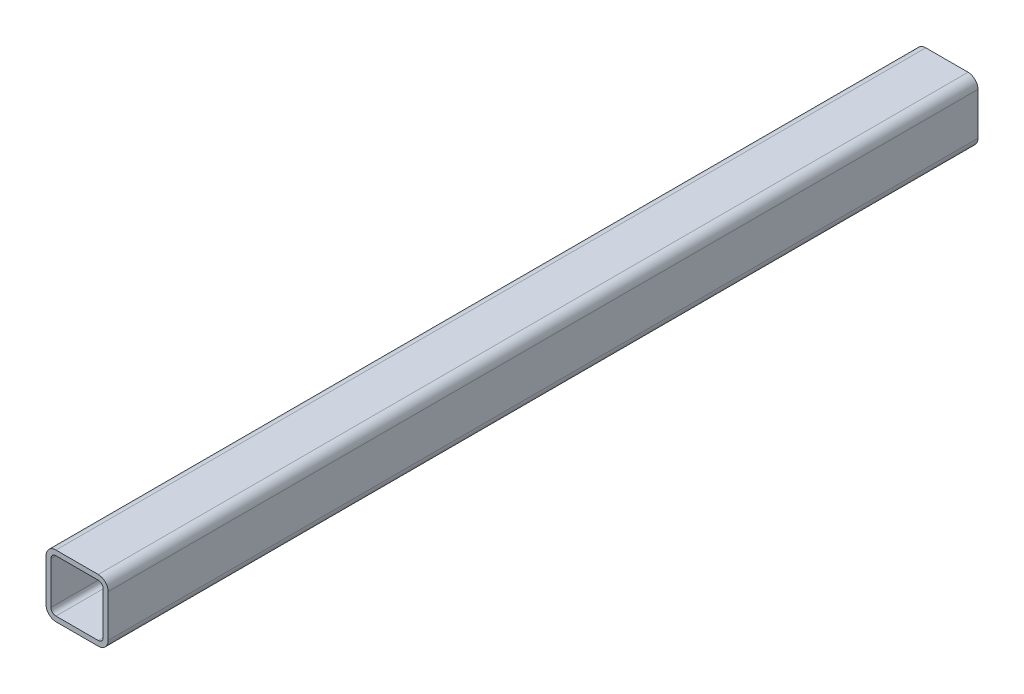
ISO-10303-21;
HEADER;
FILE_DESCRIPTION(('STEP AP214'),'2;1');
FILE_NAME('part.step','',(''),(''),'','','');
FILE_SCHEMA(('AUTOMOTIVE_DESIGN { 1 0 10303 214 1 1 1 1 }'));
ENDSEC;
DATA;
#1=APPLICATION_CONTEXT('core data for automotive mechanical design processes');
#2=APPLICATION_PROTOCOL_DEFINITION('international standard','automotive_design',2000,#1);
#3=PRODUCT_CONTEXT('',#1,'mechanical');
#4=PRODUCT('Part','Part','',(#3));
#5=PRODUCT_RELATED_PRODUCT_CATEGORY('part','',(#4));
#6=PRODUCT_DEFINITION_FORMATION('','',#4);
#7=PRODUCT_DEFINITION_CONTEXT('part definition',#1,'design');
#8=PRODUCT_DEFINITION('design','',#6,#7);
#9=PRODUCT_DEFINITION_SHAPE('','',#8);
#10=(LENGTH_UNIT() NAMED_UNIT(*) SI_UNIT(.MILLI.,.METRE.));
#11=(NAMED_UNIT(*) PLANE_ANGLE_UNIT() SI_UNIT($,.RADIAN.));
#12=(NAMED_UNIT(*) SI_UNIT($,.STERADIAN.) SOLID_ANGLE_UNIT());
#13=UNCERTAINTY_MEASURE_WITH_UNIT(LENGTH_MEASURE(1.E-05),#10,'distance_accuracy_value','');
#14=(GEOMETRIC_REPRESENTATION_CONTEXT(3) GLOBAL_UNCERTAINTY_ASSIGNED_CONTEXT((#13)) GLOBAL_UNIT_ASSIGNED_CONTEXT((#10,
#11,#12)) REPRESENTATION_CONTEXT('',''));
#15=CARTESIAN_POINT('',(0.,0.,0.));
#16=DIRECTION('',(0.,0.,1.));
#17=DIRECTION('',(1.,0.,0.));
#18=AXIS2_PLACEMENT_3D('',#15,#16,#17);
#19=CARTESIAN_POINT('',(-12.97432,12.97432,266.7));
#20=DIRECTION('',(0.,0.,1.));
#21=DIRECTION('',(1.,0.,0.));
#22=AXIS2_PLACEMENT_3D('',#19,#20,#21);
#23=PLANE('',#22);
#24=CARTESIAN_POINT('',(-12.97432,12.97432,266.7));
#25=DIRECTION('',(0.,0.,1.));
#26=DIRECTION('',(1.,0.,0.));
#27=AXIS2_PLACEMENT_3D('',#24,#25,#26);
#28=CIRCLE('',#27,6.07568);
#29=CARTESIAN_POINT('',(-12.97432,19.05,266.7));
#30=VERTEX_POINT('',#29);
#31=CARTESIAN_POINT('',(-19.05,12.97432,266.7));
#32=VERTEX_POINT('',#31);
#33=EDGE_CURVE('E260',#30,#32,#28,.T.);
#34=ORIENTED_EDGE('',*,*,#33,.T.);
#35=DIRECTION('',(0.,-1.,0.));
#36=VECTOR('',#35,1.);
#37=CARTESIAN_POINT('',(-19.05,12.97432,266.7));
#38=LINE('',#37,#36);
#39=CARTESIAN_POINT('',(-19.05,-12.97432,266.7));
#40=VERTEX_POINT('',#39);
#41=EDGE_CURVE('E263',#32,#40,#38,.T.);
#42=ORIENTED_EDGE('',*,*,#41,.T.);
#43=CARTESIAN_POINT('',(-12.97432,-12.97432,266.7));
#44=DIRECTION('',(0.,0.,1.));
#45=DIRECTION('',(-1.,0.,0.));
#46=AXIS2_PLACEMENT_3D('',#43,#44,#45);
#47=CIRCLE('',#46,6.07568);
#48=CARTESIAN_POINT('',(-12.97432,-19.05,266.7));
#49=VERTEX_POINT('',#48);
#50=EDGE_CURVE('E266',#40,#49,#47,.T.);
#51=ORIENTED_EDGE('',*,*,#50,.T.);
#52=DIRECTION('',(1.,0.,0.));
#53=VECTOR('',#52,1.);
#54=CARTESIAN_POINT('',(-12.97432,-19.05,266.7));
#55=LINE('',#54,#53);
#56=CARTESIAN_POINT('',(12.97432,-19.05,266.7));
#57=VERTEX_POINT('',#56);
#58=EDGE_CURVE('E268',#49,#57,#55,.T.);
#59=ORIENTED_EDGE('',*,*,#58,.T.);
#60=CARTESIAN_POINT('',(12.97432,-12.97432,266.7));
#61=DIRECTION('',(0.,0.,1.));
#62=DIRECTION('',(1.,0.,0.));
#63=AXIS2_PLACEMENT_3D('',#60,#61,#62);
#64=CIRCLE('',#63,6.07568);
#65=CARTESIAN_POINT('',(19.05,-12.97432,266.7));
#66=VERTEX_POINT('',#65);
#67=EDGE_CURVE('E270',#57,#66,#64,.T.);
#68=ORIENTED_EDGE('',*,*,#67,.T.);
#69=DIRECTION('',(0.,1.,0.));
#70=VECTOR('',#69,1.);
#71=CARTESIAN_POINT('',(19.05,12.97432,266.7));
#72=LINE('',#71,#70);
#73=CARTESIAN_POINT('',(19.05,12.97432,266.7));
#74=VERTEX_POINT('',#73);
#75=EDGE_CURVE('E272',#66,#74,#72,.T.);
#76=ORIENTED_EDGE('',*,*,#75,.T.);
#77=CARTESIAN_POINT('',(12.97432,12.97432,266.7));
#78=DIRECTION('',(0.,0.,1.));
#79=DIRECTION('',(1.,0.,0.));
#80=AXIS2_PLACEMENT_3D('',#77,#78,#79);
#81=CIRCLE('',#80,6.07568);
#82=CARTESIAN_POINT('',(12.97432,19.05,266.7));
#83=VERTEX_POINT('',#82);
#84=EDGE_CURVE('E274',#74,#83,#81,.T.);
#85=ORIENTED_EDGE('',*,*,#84,.T.);
#86=DIRECTION('',(-1.,0.,0.));
#87=VECTOR('',#86,1.);
#88=CARTESIAN_POINT('',(-12.97432,19.05,266.7));
#89=LINE('',#88,#87);
#90=EDGE_CURVE('E276',#83,#30,#89,.T.);
#91=ORIENTED_EDGE('',*,*,#90,.T.);
#92=EDGE_LOOP('',(#34,#42,#51,#59,#68,#76,#85,#91));
#93=FACE_BOUND('',#92,.T.);
#94=DIRECTION('',(0.,-1.,0.));
#95=VECTOR('',#94,1.);
#96=CARTESIAN_POINT('',(-16.01216,12.97432,266.7));
#97=LINE('',#96,#95);
#98=CARTESIAN_POINT('',(-16.01216,12.97432,266.7));
#99=VERTEX_POINT('',#98);
#100=CARTESIAN_POINT('',(-16.01216,-12.97432,266.7));
#101=VERTEX_POINT('',#100);
#102=EDGE_CURVE('E203',#99,#101,#97,.T.);
#103=ORIENTED_EDGE('',*,*,#102,.F.);
#104=CARTESIAN_POINT('',(-12.97432,12.97432,266.7));
#105=DIRECTION('',(0.,0.,1.));
#106=DIRECTION('',(1.,0.,0.));
#107=AXIS2_PLACEMENT_3D('',#104,#105,#106);
#108=CIRCLE('',#107,3.03784);
#109=CARTESIAN_POINT('',(-12.97432,16.01216,266.7));
#110=VERTEX_POINT('',#109);
#111=EDGE_CURVE('E195',#110,#99,#108,.T.);
#112=ORIENTED_EDGE('',*,*,#111,.F.);
#113=DIRECTION('',(-1.,0.,0.));
#114=VECTOR('',#113,1.);
#115=CARTESIAN_POINT('',(-12.97432,16.01216,266.7));
#116=LINE('',#115,#114);
#117=CARTESIAN_POINT('',(12.97432,16.01216,266.7));
#118=VERTEX_POINT('',#117);
#119=EDGE_CURVE('E228',#118,#110,#116,.T.);
#120=ORIENTED_EDGE('',*,*,#119,.F.);
#121=CARTESIAN_POINT('',(12.97432,12.97432,266.7));
#122=DIRECTION('',(0.,0.,1.));
#123=DIRECTION('',(1.,0.,0.));
#124=AXIS2_PLACEMENT_3D('',#121,#122,#123);
#125=CIRCLE('',#124,3.03784);
#126=CARTESIAN_POINT('',(16.01216,12.97432,266.7));
#127=VERTEX_POINT('',#126);
#128=EDGE_CURVE('E226',#127,#118,#125,.T.);
#129=ORIENTED_EDGE('',*,*,#128,.F.);
#130=DIRECTION('',(0.,1.,0.));
#131=VECTOR('',#130,1.);
#132=CARTESIAN_POINT('',(16.01216,12.97432,266.7));
#133=LINE('',#132,#131);
#134=CARTESIAN_POINT('',(16.01216,-12.97432,266.7));
#135=VERTEX_POINT('',#134);
#136=EDGE_CURVE('E224',#135,#127,#133,.T.);
#137=ORIENTED_EDGE('',*,*,#136,.F.);
#138=CARTESIAN_POINT('',(12.97432,-12.97432,266.7));
#139=DIRECTION('',(0.,0.,1.));
#140=DIRECTION('',(1.,0.,0.));
#141=AXIS2_PLACEMENT_3D('',#138,#139,#140);
#142=CIRCLE('',#141,3.03784);
#143=CARTESIAN_POINT('',(12.97432,-16.01216,266.7));
#144=VERTEX_POINT('',#143);
#145=EDGE_CURVE('E222',#144,#135,#142,.T.);
#146=ORIENTED_EDGE('',*,*,#145,.F.);
#147=DIRECTION('',(1.,0.,0.));
#148=VECTOR('',#147,1.);
#149=CARTESIAN_POINT('',(-12.97432,-16.01216,266.7));
#150=LINE('',#149,#148);
#151=CARTESIAN_POINT('',(-12.97432,-16.01216,266.7));
#152=VERTEX_POINT('',#151);
#153=EDGE_CURVE('E218',#152,#144,#150,.T.);
#154=ORIENTED_EDGE('',*,*,#153,.F.);
#155=CARTESIAN_POINT('',(-12.97432,-12.97432,266.7));
#156=DIRECTION('',(0.,0.,1.));
#157=DIRECTION('',(1.,0.,0.));
#158=AXIS2_PLACEMENT_3D('',#155,#156,#157);
#159=CIRCLE('',#158,3.03784);
#160=EDGE_CURVE('E216',#101,#152,#159,.T.);
#161=ORIENTED_EDGE('',*,*,#160,.F.);
#162=EDGE_LOOP('',(#103,#112,#120,#129,#137,#146,#154,#161));
#163=FACE_BOUND('',#162,.T.);
#164=ADVANCED_FACE('F82',(#93,#163),#23,.T.);
#165=CARTESIAN_POINT('',(-12.97432,12.97432,-266.7));
#166=DIRECTION('',(0.,0.,1.));
#167=DIRECTION('',(1.,0.,0.));
#168=AXIS2_PLACEMENT_3D('',#165,#166,#167);
#169=PLANE('',#168);
#170=CARTESIAN_POINT('',(-12.97432,12.97432,-266.7));
#171=DIRECTION('',(0.,0.,1.));
#172=DIRECTION('',(1.,0.,0.));
#173=AXIS2_PLACEMENT_3D('',#170,#171,#172);
#174=CIRCLE('',#173,6.07568);
#175=CARTESIAN_POINT('',(-12.97432,19.05,-266.7));
#176=VERTEX_POINT('',#175);
#177=CARTESIAN_POINT('',(-19.05,12.97432,-266.7));
#178=VERTEX_POINT('',#177);
#179=EDGE_CURVE('E211',#176,#178,#174,.T.);
#180=ORIENTED_EDGE('',*,*,#179,.F.);
#181=DIRECTION('',(-1.,0.,0.));
#182=VECTOR('',#181,1.);
#183=CARTESIAN_POINT('',(-12.97432,19.05,-266.7));
#184=LINE('',#183,#182);
#185=CARTESIAN_POINT('',(12.97432,19.05,-266.7));
#186=VERTEX_POINT('',#185);
#187=EDGE_CURVE('E264',#186,#176,#184,.T.);
#188=ORIENTED_EDGE('',*,*,#187,.F.);
#189=CARTESIAN_POINT('',(12.97432,12.97432,-266.7));
#190=DIRECTION('',(0.,0.,1.));
#191=DIRECTION('',(1.,0.,0.));
#192=AXIS2_PLACEMENT_3D('',#189,#190,#191);
#193=CIRCLE('',#192,6.07568);
#194=CARTESIAN_POINT('',(19.05,12.97432,-266.7));
#195=VERTEX_POINT('',#194);
#196=EDGE_CURVE('E291',#195,#186,#193,.T.);
#197=ORIENTED_EDGE('',*,*,#196,.F.);
#198=DIRECTION('',(0.,1.,0.));
#199=VECTOR('',#198,1.);
#200=CARTESIAN_POINT('',(19.05,12.97432,-266.7));
#201=LINE('',#200,#199);
#202=CARTESIAN_POINT('',(19.05,-12.97432,-266.7));
#203=VERTEX_POINT('',#202);
#204=EDGE_CURVE('E289',#203,#195,#201,.T.);
#205=ORIENTED_EDGE('',*,*,#204,.F.);
#206=CARTESIAN_POINT('',(12.97432,-12.97432,-266.7));
#207=DIRECTION('',(0.,0.,1.));
#208=DIRECTION('',(1.,0.,0.));
#209=AXIS2_PLACEMENT_3D('',#206,#207,#208);
#210=CIRCLE('',#209,6.07568);
#211=CARTESIAN_POINT('',(12.97432,-19.05,-266.7));
#212=VERTEX_POINT('',#211);
#213=EDGE_CURVE('E287',#212,#203,#210,.T.);
#214=ORIENTED_EDGE('',*,*,#213,.F.);
#215=DIRECTION('',(1.,0.,0.));
#216=VECTOR('',#215,1.);
#217=CARTESIAN_POINT('',(-12.97432,-19.05,-266.7));
#218=LINE('',#217,#216);
#219=CARTESIAN_POINT('',(-12.97432,-19.05,-266.7));
#220=VERTEX_POINT('',#219);
#221=EDGE_CURVE('E285',#220,#212,#218,.T.);
#222=ORIENTED_EDGE('',*,*,#221,.F.);
#223=CARTESIAN_POINT('',(-12.97432,-12.97432,-266.7));
#224=DIRECTION('',(0.,0.,1.));
#225=DIRECTION('',(-1.,0.,0.));
#226=AXIS2_PLACEMENT_3D('',#223,#224,#225);
#227=CIRCLE('',#226,6.07568);
#228=CARTESIAN_POINT('',(-19.05,-12.97432,-266.7));
#229=VERTEX_POINT('',#228);
#230=EDGE_CURVE('E283',#229,#220,#227,.T.);
#231=ORIENTED_EDGE('',*,*,#230,.F.);
#232=DIRECTION('',(0.,-1.,0.));
#233=VECTOR('',#232,1.);
#234=CARTESIAN_POINT('',(-19.05,12.97432,-266.7));
#235=LINE('',#234,#233);
#236=EDGE_CURVE('E281',#178,#229,#235,.T.);
#237=ORIENTED_EDGE('',*,*,#236,.F.);
#238=EDGE_LOOP('',(#180,#188,#197,#205,#214,#222,#231,#237));
#239=FACE_BOUND('',#238,.T.);
#240=CARTESIAN_POINT('',(-12.97432,12.97432,-266.7));
#241=DIRECTION('',(0.,0.,1.));
#242=DIRECTION('',(1.,0.,0.));
#243=AXIS2_PLACEMENT_3D('',#240,#241,#242);
#244=CIRCLE('',#243,3.03784);
#245=CARTESIAN_POINT('',(-12.97432,16.01216,-266.7));
#246=VERTEX_POINT('',#245);
#247=CARTESIAN_POINT('',(-16.01216,12.97432,-266.7));
#248=VERTEX_POINT('',#247);
#249=EDGE_CURVE('E105',#246,#248,#244,.T.);
#250=ORIENTED_EDGE('',*,*,#249,.T.);
#251=DIRECTION('',(0.,-1.,0.));
#252=VECTOR('',#251,1.);
#253=CARTESIAN_POINT('',(-16.01216,12.97432,-266.7));
#254=LINE('',#253,#252);
#255=CARTESIAN_POINT('',(-16.01216,-12.97432,-266.7));
#256=VERTEX_POINT('',#255);
#257=EDGE_CURVE('E210',#248,#256,#254,.T.);
#258=ORIENTED_EDGE('',*,*,#257,.T.);
#259=CARTESIAN_POINT('',(-12.97432,-12.97432,-266.7));
#260=DIRECTION('',(0.,0.,1.));
#261=DIRECTION('',(1.,0.,0.));
#262=AXIS2_PLACEMENT_3D('',#259,#260,#261);
#263=CIRCLE('',#262,3.03784);
#264=CARTESIAN_POINT('',(-12.97432,-16.01216,-266.7));
#265=VERTEX_POINT('',#264);
#266=EDGE_CURVE('E232',#256,#265,#263,.T.);
#267=ORIENTED_EDGE('',*,*,#266,.T.);
#268=DIRECTION('',(1.,0.,0.));
#269=VECTOR('',#268,1.);
#270=CARTESIAN_POINT('',(-12.97432,-16.01216,-266.7));
#271=LINE('',#270,#269);
#272=CARTESIAN_POINT('',(12.97432,-16.01216,-266.7));
#273=VERTEX_POINT('',#272);
#274=EDGE_CURVE('E235',#265,#273,#271,.T.);
#275=ORIENTED_EDGE('',*,*,#274,.T.);
#276=CARTESIAN_POINT('',(12.97432,-12.97432,-266.7));
#277=DIRECTION('',(0.,0.,1.));
#278=DIRECTION('',(1.,0.,0.));
#279=AXIS2_PLACEMENT_3D('',#276,#277,#278);
#280=CIRCLE('',#279,3.03784);
#281=CARTESIAN_POINT('',(16.01216,-12.97432,-266.7));
#282=VERTEX_POINT('',#281);
#283=EDGE_CURVE('E238',#273,#282,#280,.T.);
#284=ORIENTED_EDGE('',*,*,#283,.T.);
#285=DIRECTION('',(0.,1.,0.));
#286=VECTOR('',#285,1.);
#287=CARTESIAN_POINT('',(16.01216,12.97432,-266.7));
#288=LINE('',#287,#286);
#289=CARTESIAN_POINT('',(16.01216,12.97432,-266.7));
#290=VERTEX_POINT('',#289);
#291=EDGE_CURVE('E241',#282,#290,#288,.T.);
#292=ORIENTED_EDGE('',*,*,#291,.T.);
#293=CARTESIAN_POINT('',(12.97432,12.97432,-266.7));
#294=DIRECTION('',(0.,0.,1.));
#295=DIRECTION('',(1.,0.,0.));
#296=AXIS2_PLACEMENT_3D('',#293,#294,#295);
#297=CIRCLE('',#296,3.03784);
#298=CARTESIAN_POINT('',(12.97432,16.01216,-266.7));
#299=VERTEX_POINT('',#298);
#300=EDGE_CURVE('E244',#290,#299,#297,.T.);
#301=ORIENTED_EDGE('',*,*,#300,.T.);
#302=DIRECTION('',(-1.,0.,0.));
#303=VECTOR('',#302,1.);
#304=CARTESIAN_POINT('',(-12.97432,16.01216,-266.7));
#305=LINE('',#304,#303);
#306=EDGE_CURVE('E204',#299,#246,#305,.T.);
#307=ORIENTED_EDGE('',*,*,#306,.T.);
#308=EDGE_LOOP('',(#250,#258,#267,#275,#284,#292,#301,#307));
#309=FACE_BOUND('',#308,.T.);
#310=ADVANCED_FACE('F321',(#239,#309),#169,.F.);
#311=CARTESIAN_POINT('',(-12.97432,12.97432,266.7));
#312=DIRECTION('',(0.,0.,-1.));
#313=DIRECTION('',(-1.,0.,0.));
#314=AXIS2_PLACEMENT_3D('',#311,#312,#313);
#315=CYLINDRICAL_SURFACE('',#314,6.07568);
#316=ORIENTED_EDGE('',*,*,#179,.T.);
#317=DIRECTION('',(0.,0.,-1.));
#318=VECTOR('',#317,1.);
#319=CARTESIAN_POINT('',(-19.05,12.97432,266.7));
#320=LINE('',#319,#318);
#321=EDGE_CURVE('E12',#32,#178,#320,.T.);
#322=ORIENTED_EDGE('',*,*,#321,.F.);
#323=ORIENTED_EDGE('',*,*,#33,.F.);
#324=DIRECTION('',(0.,0.,-1.));
#325=VECTOR('',#324,1.);
#326=CARTESIAN_POINT('',(-12.97432,19.05,266.7));
#327=LINE('',#326,#325);
#328=EDGE_CURVE('E278',#30,#176,#327,.T.);
#329=ORIENTED_EDGE('',*,*,#328,.T.);
#330=EDGE_LOOP('',(#316,#322,#323,#329));
#331=FACE_BOUND('',#330,.T.);
#332=ADVANCED_FACE('F84',(#331),#315,.T.);
#333=CARTESIAN_POINT('',(-19.05,12.97432,266.7));
#334=DIRECTION('',(1.,0.,0.));
#335=DIRECTION('',(0.,1.,0.));
#336=AXIS2_PLACEMENT_3D('',#333,#334,#335);
#337=PLANE('',#336);
#338=ORIENTED_EDGE('',*,*,#236,.T.);
#339=DIRECTION('',(0.,0.,-1.));
#340=VECTOR('',#339,1.);
#341=CARTESIAN_POINT('',(-19.05,-12.97432,266.7));
#342=LINE('',#341,#340);
#343=EDGE_CURVE('E90',#40,#229,#342,.T.);
#344=ORIENTED_EDGE('',*,*,#343,.F.);
#345=ORIENTED_EDGE('',*,*,#41,.F.);
#346=ORIENTED_EDGE('',*,*,#321,.T.);
#347=EDGE_LOOP('',(#338,#344,#345,#346));
#348=FACE_BOUND('',#347,.T.);
#349=ADVANCED_FACE('F338',(#348),#337,.F.);
#350=CARTESIAN_POINT('',(-12.97432,-12.97432,266.7));
#351=DIRECTION('',(0.,0.,-1.));
#352=DIRECTION('',(-1.,0.,0.));
#353=AXIS2_PLACEMENT_3D('',#350,#351,#352);
#354=CYLINDRICAL_SURFACE('',#353,6.07568);
#355=ORIENTED_EDGE('',*,*,#230,.T.);
#356=DIRECTION('',(0.,0.,-1.));
#357=VECTOR('',#356,1.);
#358=CARTESIAN_POINT('',(-12.97432,-19.05,266.7));
#359=LINE('',#358,#357);
#360=EDGE_CURVE('E308',#49,#220,#359,.T.);
#361=ORIENTED_EDGE('',*,*,#360,.F.);
#362=ORIENTED_EDGE('',*,*,#50,.F.);
#363=ORIENTED_EDGE('',*,*,#343,.T.);
#364=EDGE_LOOP('',(#355,#361,#362,#363));
#365=FACE_BOUND('',#364,.T.);
#366=ADVANCED_FACE('F315',(#365),#354,.T.);
#367=CARTESIAN_POINT('',(-12.97432,-19.05,266.7));
#368=DIRECTION('',(0.,1.,0.));
#369=DIRECTION('',(0.,0.,1.));
#370=AXIS2_PLACEMENT_3D('',#367,#368,#369);
#371=PLANE('',#370);
#372=ORIENTED_EDGE('',*,*,#221,.T.);
#373=DIRECTION('',(0.,0.,-1.));
#374=VECTOR('',#373,1.);
#375=CARTESIAN_POINT('',(12.97432,-19.05,266.7));
#376=LINE('',#375,#374);
#377=EDGE_CURVE('E305',#57,#212,#376,.T.);
#378=ORIENTED_EDGE('',*,*,#377,.F.);
#379=ORIENTED_EDGE('',*,*,#58,.F.);
#380=ORIENTED_EDGE('',*,*,#360,.T.);
#381=EDGE_LOOP('',(#372,#378,#379,#380));
#382=FACE_BOUND('',#381,.T.);
#383=ADVANCED_FACE('F327',(#382),#371,.F.);
#384=CARTESIAN_POINT('',(12.97432,-12.97432,266.7));
#385=DIRECTION('',(0.,0.,-1.));
#386=DIRECTION('',(-1.,0.,0.));
#387=AXIS2_PLACEMENT_3D('',#384,#385,#386);
#388=CYLINDRICAL_SURFACE('',#387,6.07568);
#389=ORIENTED_EDGE('',*,*,#213,.T.);
#390=DIRECTION('',(0.,0.,-1.));
#391=VECTOR('',#390,1.);
#392=CARTESIAN_POINT('',(19.05,-12.97432,266.7));
#393=LINE('',#392,#391);
#394=EDGE_CURVE('E302',#66,#203,#393,.T.);
#395=ORIENTED_EDGE('',*,*,#394,.F.);
#396=ORIENTED_EDGE('',*,*,#67,.F.);
#397=ORIENTED_EDGE('',*,*,#377,.T.);
#398=EDGE_LOOP('',(#389,#395,#396,#397));
#399=FACE_BOUND('',#398,.T.);
#400=ADVANCED_FACE('F331',(#399),#388,.T.);
#401=CARTESIAN_POINT('',(19.05,12.97432,266.7));
#402=DIRECTION('',(-1.,0.,0.));
#403=DIRECTION('',(0.,-1.,0.));
#404=AXIS2_PLACEMENT_3D('',#401,#402,#403);
#405=PLANE('',#404);
#406=ORIENTED_EDGE('',*,*,#204,.T.);
#407=DIRECTION('',(0.,0.,-1.));
#408=VECTOR('',#407,1.);
#409=CARTESIAN_POINT('',(19.05,12.97432,266.7));
#410=LINE('',#409,#408);
#411=EDGE_CURVE('E299',#74,#195,#410,.T.);
#412=ORIENTED_EDGE('',*,*,#411,.F.);
#413=ORIENTED_EDGE('',*,*,#75,.F.);
#414=ORIENTED_EDGE('',*,*,#394,.T.);
#415=EDGE_LOOP('',(#406,#412,#413,#414));
#416=FACE_BOUND('',#415,.T.);
#417=ADVANCED_FACE('F351',(#416),#405,.F.);
#418=CARTESIAN_POINT('',(12.97432,12.97432,266.7));
#419=DIRECTION('',(0.,0.,-1.));
#420=DIRECTION('',(-1.,0.,0.));
#421=AXIS2_PLACEMENT_3D('',#418,#419,#420);
#422=CYLINDRICAL_SURFACE('',#421,6.07568);
#423=ORIENTED_EDGE('',*,*,#196,.T.);
#424=DIRECTION('',(0.,0.,-1.));
#425=VECTOR('',#424,1.);
#426=CARTESIAN_POINT('',(12.97432,19.05,266.7));
#427=LINE('',#426,#425);
#428=EDGE_CURVE('E296',#83,#186,#427,.T.);
#429=ORIENTED_EDGE('',*,*,#428,.F.);
#430=ORIENTED_EDGE('',*,*,#84,.F.);
#431=ORIENTED_EDGE('',*,*,#411,.T.);
#432=EDGE_LOOP('',(#423,#429,#430,#431));
#433=FACE_BOUND('',#432,.T.);
#434=ADVANCED_FACE('F349',(#433),#422,.T.);
#435=CARTESIAN_POINT('',(-12.97432,19.05,266.7));
#436=DIRECTION('',(0.,-1.,0.));
#437=DIRECTION('',(0.,0.,-1.));
#438=AXIS2_PLACEMENT_3D('',#435,#436,#437);
#439=PLANE('',#438);
#440=ORIENTED_EDGE('',*,*,#187,.T.);
#441=ORIENTED_EDGE('',*,*,#328,.F.);
#442=ORIENTED_EDGE('',*,*,#90,.F.);
#443=ORIENTED_EDGE('',*,*,#428,.T.);
#444=EDGE_LOOP('',(#440,#441,#442,#443));
#445=FACE_BOUND('',#444,.T.);
#446=ADVANCED_FACE('F344',(#445),#439,.F.);
#447=CARTESIAN_POINT('',(-12.97432,12.97432,266.7));
#448=DIRECTION('',(0.,0.,-1.));
#449=DIRECTION('',(-1.,0.,0.));
#450=AXIS2_PLACEMENT_3D('',#447,#448,#449);
#451=CYLINDRICAL_SURFACE('',#450,3.03784);
#452=ORIENTED_EDGE('',*,*,#249,.F.);
#453=DIRECTION('',(0.,0.,-1.));
#454=VECTOR('',#453,1.);
#455=CARTESIAN_POINT('',(-12.97432,16.01216,266.7));
#456=LINE('',#455,#454);
#457=EDGE_CURVE('E199',#110,#246,#456,.T.);
#458=ORIENTED_EDGE('',*,*,#457,.F.);
#459=ORIENTED_EDGE('',*,*,#111,.T.);
#460=DIRECTION('',(0.,0.,-1.));
#461=VECTOR('',#460,1.);
#462=CARTESIAN_POINT('',(-16.01216,12.97432,266.7));
#463=LINE('',#462,#461);
#464=EDGE_CURVE('E198',#99,#248,#463,.T.);
#465=ORIENTED_EDGE('',*,*,#464,.T.);
#466=EDGE_LOOP('',(#452,#458,#459,#465));
#467=FACE_BOUND('',#466,.T.);
#468=ADVANCED_FACE('F197',(#467),#451,.F.);
#469=CARTESIAN_POINT('',(-16.01216,12.97432,266.7));
#470=DIRECTION('',(1.,0.,0.));
#471=DIRECTION('',(0.,1.,0.));
#472=AXIS2_PLACEMENT_3D('',#469,#470,#471);
#473=PLANE('',#472);
#474=ORIENTED_EDGE('',*,*,#257,.F.);
#475=ORIENTED_EDGE('',*,*,#464,.F.);
#476=ORIENTED_EDGE('',*,*,#102,.T.);
#477=DIRECTION('',(0.,0.,-1.));
#478=VECTOR('',#477,1.);
#479=CARTESIAN_POINT('',(-16.01216,-12.97432,266.7));
#480=LINE('',#479,#478);
#481=EDGE_CURVE('E212',#101,#256,#480,.T.);
#482=ORIENTED_EDGE('',*,*,#481,.T.);
#483=EDGE_LOOP('',(#474,#475,#476,#482));
#484=FACE_BOUND('',#483,.T.);
#485=ADVANCED_FACE('F207',(#484),#473,.T.);
#486=CARTESIAN_POINT('',(-12.97432,-12.97432,266.7));
#487=DIRECTION('',(0.,0.,-1.));
#488=DIRECTION('',(-1.,0.,0.));
#489=AXIS2_PLACEMENT_3D('',#486,#487,#488);
#490=CYLINDRICAL_SURFACE('',#489,3.03784);
#491=ORIENTED_EDGE('',*,*,#266,.F.);
#492=ORIENTED_EDGE('',*,*,#481,.F.);
#493=ORIENTED_EDGE('',*,*,#160,.T.);
#494=DIRECTION('',(0.,0.,-1.));
#495=VECTOR('',#494,1.);
#496=CARTESIAN_POINT('',(-12.97432,-16.01216,266.7));
#497=LINE('',#496,#495);
#498=EDGE_CURVE('E257',#152,#265,#497,.T.);
#499=ORIENTED_EDGE('',*,*,#498,.T.);
#500=EDGE_LOOP('',(#491,#492,#493,#499));
#501=FACE_BOUND('',#500,.T.);
#502=ADVANCED_FACE('F376',(#501),#490,.F.);
#503=CARTESIAN_POINT('',(-12.97432,-16.01216,266.7));
#504=DIRECTION('',(0.,1.,0.));
#505=DIRECTION('',(0.,0.,1.));
#506=AXIS2_PLACEMENT_3D('',#503,#504,#505);
#507=PLANE('',#506);
#508=ORIENTED_EDGE('',*,*,#274,.F.);
#509=ORIENTED_EDGE('',*,*,#498,.F.);
#510=ORIENTED_EDGE('',*,*,#153,.T.);
#511=DIRECTION('',(0.,0.,-1.));
#512=VECTOR('',#511,1.);
#513=CARTESIAN_POINT('',(12.97432,-16.01216,266.7));
#514=LINE('',#513,#512);
#515=EDGE_CURVE('E255',#144,#273,#514,.T.);
#516=ORIENTED_EDGE('',*,*,#515,.T.);
#517=EDGE_LOOP('',(#508,#509,#510,#516));
#518=FACE_BOUND('',#517,.T.);
#519=ADVANCED_FACE('F380',(#518),#507,.T.);
#520=CARTESIAN_POINT('',(12.97432,-12.97432,266.7));
#521=DIRECTION('',(0.,0.,-1.));
#522=DIRECTION('',(-1.,0.,0.));
#523=AXIS2_PLACEMENT_3D('',#520,#521,#522);
#524=CYLINDRICAL_SURFACE('',#523,3.03784);
#525=ORIENTED_EDGE('',*,*,#283,.F.);
#526=ORIENTED_EDGE('',*,*,#515,.F.);
#527=ORIENTED_EDGE('',*,*,#145,.T.);
#528=DIRECTION('',(0.,0.,-1.));
#529=VECTOR('',#528,1.);
#530=CARTESIAN_POINT('',(16.01216,-12.97432,266.7));
#531=LINE('',#530,#529);
#532=EDGE_CURVE('E253',#135,#282,#531,.T.);
#533=ORIENTED_EDGE('',*,*,#532,.T.);
#534=EDGE_LOOP('',(#525,#526,#527,#533));
#535=FACE_BOUND('',#534,.T.);
#536=ADVANCED_FACE('F386',(#535),#524,.F.);
#537=CARTESIAN_POINT('',(16.01216,12.97432,266.7));
#538=DIRECTION('',(-1.,0.,0.));
#539=DIRECTION('',(0.,-1.,0.));
#540=AXIS2_PLACEMENT_3D('',#537,#538,#539);
#541=PLANE('',#540);
#542=ORIENTED_EDGE('',*,*,#291,.F.);
#543=ORIENTED_EDGE('',*,*,#532,.F.);
#544=ORIENTED_EDGE('',*,*,#136,.T.);
#545=DIRECTION('',(0.,0.,-1.));
#546=VECTOR('',#545,1.);
#547=CARTESIAN_POINT('',(16.01216,12.97432,266.7));
#548=LINE('',#547,#546);
#549=EDGE_CURVE('E251',#127,#290,#548,.T.);
#550=ORIENTED_EDGE('',*,*,#549,.T.);
#551=EDGE_LOOP('',(#542,#543,#544,#550));
#552=FACE_BOUND('',#551,.T.);
#553=ADVANCED_FACE('F390',(#552),#541,.T.);
#554=CARTESIAN_POINT('',(12.97432,12.97432,266.7));
#555=DIRECTION('',(0.,0.,-1.));
#556=DIRECTION('',(-1.,0.,0.));
#557=AXIS2_PLACEMENT_3D('',#554,#555,#556);
#558=CYLINDRICAL_SURFACE('',#557,3.03784);
#559=ORIENTED_EDGE('',*,*,#300,.F.);
#560=ORIENTED_EDGE('',*,*,#549,.F.);
#561=ORIENTED_EDGE('',*,*,#128,.T.);
#562=DIRECTION('',(0.,0.,-1.));
#563=VECTOR('',#562,1.);
#564=CARTESIAN_POINT('',(12.97432,16.01216,266.7));
#565=LINE('',#564,#563);
#566=EDGE_CURVE('E97',#118,#299,#565,.T.);
#567=ORIENTED_EDGE('',*,*,#566,.T.);
#568=EDGE_LOOP('',(#559,#560,#561,#567));
#569=FACE_BOUND('',#568,.T.);
#570=ADVANCED_FACE('F394',(#569),#558,.F.);
#571=CARTESIAN_POINT('',(-12.97432,16.01216,266.7));
#572=DIRECTION('',(0.,-1.,0.));
#573=DIRECTION('',(0.,0.,-1.));
#574=AXIS2_PLACEMENT_3D('',#571,#572,#573);
#575=PLANE('',#574);
#576=ORIENTED_EDGE('',*,*,#306,.F.);
#577=ORIENTED_EDGE('',*,*,#566,.F.);
#578=ORIENTED_EDGE('',*,*,#119,.T.);
#579=ORIENTED_EDGE('',*,*,#457,.T.);
#580=EDGE_LOOP('',(#576,#577,#578,#579));
#581=FACE_BOUND('',#580,.T.);
#582=ADVANCED_FACE('F398',(#581),#575,.T.);
#583=CLOSED_SHELL('',(#164,#310,#332,#349,#366,#383,#400,#417,#434,#446,#468,#485,#502,#519,
#536,#553,#570,#582));
#584=MANIFOLD_SOLID_BREP('B2',#583);
#585=ADVANCED_BREP_SHAPE_REPRESENTATION('',(#18,#584),#14);
#586=SHAPE_DEFINITION_REPRESENTATION(#9,#585);
ENDSEC;
END-ISO-10303-21;
